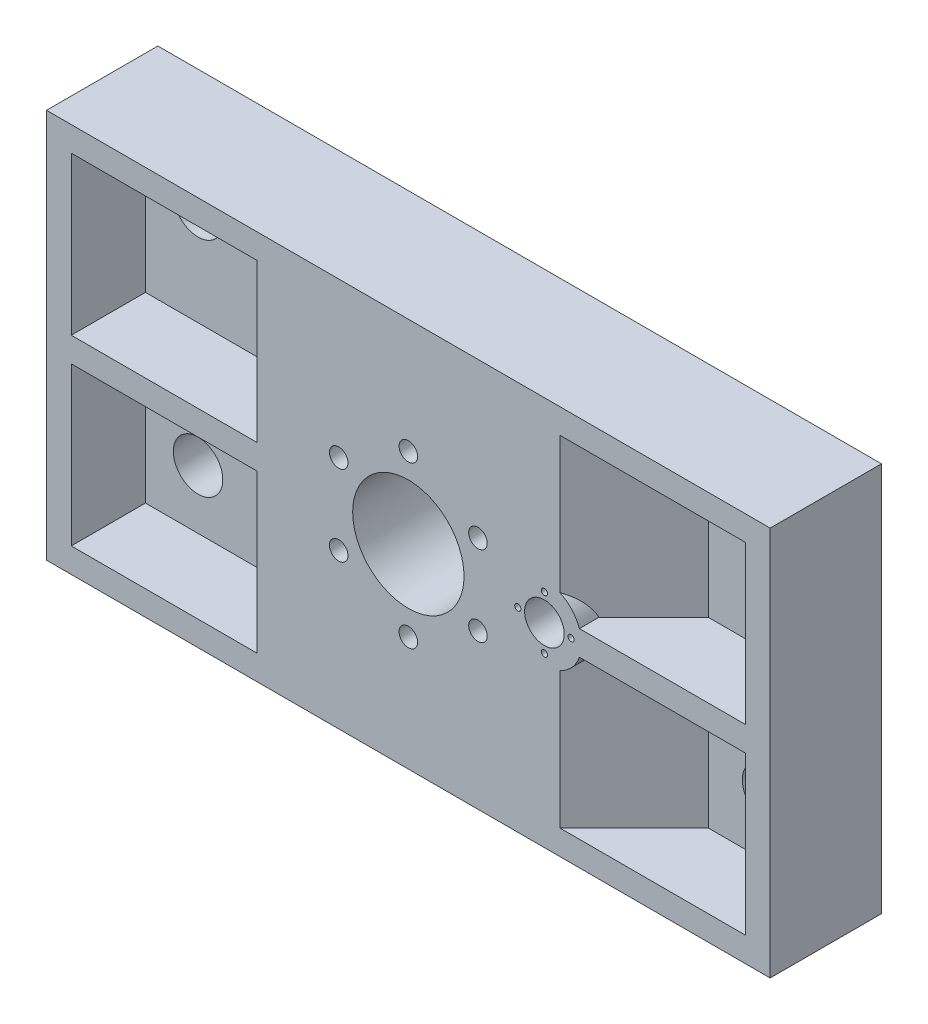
from build123d import *

# Parameters (mm, degrees)
SKETCH_1_W                = 585
SKETCH_1_H                = 315
SKETCH_1_R                = 45
SKETCH_1_R_2              = 7.5
SKETCH_1_R_3              = 20
SKETCH_1_R_4              = 16
SKETCH_1_R_5              = 2.5
EXTRUDE_1_DEPTH           = 90
SKETCH_2_W                = 90
SKETCH_2_H                = 127.5
CUT_EXTRUDE_1_DEPTH       = 60
CUT_EXTRUDE_2_DEPTH       = 127.5
CUT_EXTRUDE_3_DEPTH       = 127.5
CUT_EXTRUDE_4_DEPTH       = 127.5
CUT_EXTRUDE_5_DEPTH       = 127.5
EXTRUDE_2_REACH           = 346.184
CUT_EXTRUDE_START         = -60
CUT_EXTRUDE_6_DEPTH       = 60
EXTRUDE_START             = 40
SKETCH_9_R                = 7.5
SKETCH_9_R_2              = 45
EXTRUDE_7_DEPTH           = 40
CUT_EXTRUDE_8_DEPTH       = 127.5
CUT_EXTRUDE_9_DEPTH       = 127.5
CUT_EXTRUDE_16_DEPTH      = 48
CUT_EXTRUDE_16_DEPTH_BACK = 55
SKETCH_15_W               = 20
SKETCH_15_H               = 20
CUT_EXTRUDE_17_DEPTH      = 2
EXTRUDE_START_2           = -40
SKETCH_16_R               = 2.5
EXTRUDE_8_DEPTH           = 40
SKETCH_17_R               = 12.5
CUT_EXTRUDE_18_DEPTH      = 20


with BuildPart() as part:
    # Sketch 1 → Extrude 1 (new body)
    with BuildSketch(Plane.XY):
        Rectangle(SKETCH_1_W, SKETCH_1_H)
        with Locations(Location((0, 0, 0), (0, 0, 180))):
            Circle(SKETCH_1_R, mode=Mode.SUBTRACT)
        with Locations(Location((0, -65, 0), (0, 0, 180))):
            Circle(SKETCH_1_R_2, mode=Mode.SUBTRACT)
        with Locations(Location((-56.291651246, -32.5, 0), (0, 0, 180))):
            Circle(SKETCH_1_R_2, mode=Mode.SUBTRACT)
        with Locations(Location((-56.291651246, 32.5, 0), (0, 0, 180))):
            Circle(SKETCH_1_R_2, mode=Mode.SUBTRACT)
        with Locations(Location((0, 65, 0), (0, 0, 180))):
            Circle(SKETCH_1_R_2, mode=Mode.SUBTRACT)
        with Locations(Location((56.291651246, 32.5, 0), (0, 0, 180))):
            Circle(SKETCH_1_R_2, mode=Mode.SUBTRACT)
        with Locations(Location((56.291651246, -32.5, 0), (0, 0, 180))):
            Circle(SKETCH_1_R_2, mode=Mode.SUBTRACT)
        with Locations(Location((-230, -90, 0), (0, 0, 180))):
            Circle(SKETCH_1_R_3, mode=Mode.SUBTRACT)
        with Locations(Location((-230, 90, 0), (0, 0, 180))):
            Circle(SKETCH_1_R_3, mode=Mode.SUBTRACT)
        with Locations(Location((230, -90, 0), (0, 0, 180))):
            Circle(SKETCH_1_R_3, mode=Mode.SUBTRACT)
        with Locations(Location((230, 90, 0), (0, 0, 180))):
            Circle(SKETCH_1_R_3, mode=Mode.SUBTRACT)
        with Locations(Location((110, 0, 0), (0, 0, 180))):
            Circle(SKETCH_1_R_4, mode=Mode.SUBTRACT)
        with Locations(Location((110, -21.5, 0), (0, 0, 180))):
            Circle(SKETCH_1_R_5, mode=Mode.SUBTRACT)
        with Locations(Location((131.5, 0, 0), (0, 0, 180))):
            Circle(SKETCH_1_R_5, mode=Mode.SUBTRACT)
        with Locations(Location((88.5, 0, 0), (0, 0, 180))):
            Circle(SKETCH_1_R_5, mode=Mode.SUBTRACT)
        with Locations(Location((110, 21.5, 0), (0, 0, 180))):
            Circle(SKETCH_1_R_5, mode=Mode.SUBTRACT)
    extrude(amount=EXTRUDE_1_DEPTH)

    # Sketch 2 → Cut-Extrude 1 (cut)
    with BuildSketch(Plane.XY.offset(90)):
        with Locations((-227.5, 73.75)):
            Rectangle(SKETCH_2_W, SKETCH_2_H)
        with Locations((-227.5, -73.75)):
            Rectangle(SKETCH_2_W, SKETCH_2_H)
        with Locations((227.5, -73.75)):
            Rectangle(SKETCH_2_W, SKETCH_2_H)
        with Locations((227.5, 73.75)):
            Rectangle(SKETCH_2_W, SKETCH_2_H)
    extrude(amount=-CUT_EXTRUDE_1_DEPTH, mode=Mode.SUBTRACT)

    # Sketch 3 → Cut-Extrude 2 (cut)
    with BuildSketch(Plane.XZ.offset(10)):
        Polygon((-182.5, 30), (-122.5, 90), (-182.5, 90), align=None)
    extrude(amount=CUT_EXTRUDE_2_DEPTH, mode=Mode.SUBTRACT)

    # Sketch 4 → Cut-Extrude 3 (cut)
    with BuildSketch(Plane.XZ.offset(-137.5)):
        Polygon((-122.5, 90), (-182.5, 90), (-182.5, 30), align=None)
    extrude(amount=CUT_EXTRUDE_3_DEPTH, mode=Mode.SUBTRACT)

    # Sketch 5 → Cut-Extrude 4 (cut)
    with BuildSketch(Plane.XZ.offset(10)):
        Polygon((182.5, 30), (182.5, 90), (122.5, 90), align=None)
    extrude(amount=CUT_EXTRUDE_4_DEPTH, mode=Mode.SUBTRACT)

    # Sketch 6 → Cut-Extrude 5 (cut)
    with BuildSketch(Plane.XZ.offset(-137.5)):
        Polygon((182.5, 90), (122.5, 90), (182.5, 30), align=None)
    extrude(amount=CUT_EXTRUDE_5_DEPTH, mode=Mode.SUBTRACT)

    # Extrude 2: up to this face of the body (flat: up to its plane)
    extrude_2_end = Plane(part.part.faces().sort_by_distance((152.5, -73.75, 60))[0])
    # Sketch 7 → Extrude 2 (add, up to the picked face)
    with BuildSketch(Plane.XY.offset(90), mode=Mode.PRIVATE) as extrude_2_sk1:
        with BuildLine():
            Line((122.5, 10), (122.5, 27.271780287))
            ThreePointArc((122.5, 27.271780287), (132.145378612, 20.238137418), (138.284271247, 10))
            Line((138.284271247, 10), (122.5, 10))
        make_face()
    extrude_2_tool1 = split(extrude(extrude_2_sk1.sketch, amount=-EXTRUDE_2_REACH, mode=Mode.PRIVATE), bisect_by=extrude_2_end, keep=Keep.BOTH, mode=Mode.PRIVATE)
    # Sketch 7 → Extrude 2 (add, up to the picked face)
    with BuildSketch(Plane.XY.offset(90), mode=Mode.PRIVATE) as extrude_2_sk2:
        with BuildLine():
            Line((138.284271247, -10), (122.5, -10))
            Line((122.5, -10), (122.5, -27.271780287))
            ThreePointArc((122.5, -27.271780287), (132.145378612, -20.238137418), (138.284271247, -10))
        make_face()
    extrude_2_tool2 = split(extrude(extrude_2_sk2.sketch, amount=-EXTRUDE_2_REACH, mode=Mode.PRIVATE), bisect_by=extrude_2_end, keep=Keep.BOTH, mode=Mode.PRIVATE)
    add(extrude_2_tool1.solids().sort_by(Axis((128.4786, 16.514723, 90), (0, 0, -1)))[0])
    add(extrude_2_tool2.solids().sort_by(Axis((128.4786, -16.514723, 90), (0, 0, -1)))[0])

    # Sketch 8 → Cut-Extrude 6 (cut)
    with BuildSketch(Plane(origin=(0, 0, 0), x_dir=(-1, 0, 0), z_dir=(0, 0, -1)).offset(CUT_EXTRUDE_START)):
        with BuildLine():
            Line((-102.5, -29.047375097), (-102.5, -137.5))
            Line((-102.5, -137.5), (102.5, -137.5))
            Line((102.5, -137.5), (102.5, 137.5))
            Line((102.5, 137.5), (-102.5, 137.5))
            Line((-102.5, 137.5), (-102.5, 29.047375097))
            ThreePointArc((-102.5, 29.047375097), (-80, 0), (-102.5, -29.047375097))
        make_face()
    extrude(amount=CUT_EXTRUDE_6_DEPTH, mode=Mode.SUBTRACT)

    # Sketch 9 → Extrude 7 (add)
    with BuildSketch(Plane(origin=(0, 0, 60), x_dir=(-1, 0, 0), z_dir=(0, 0, -1)).offset(EXTRUDE_START)):
        with BuildLine():
            Line((10, 79.372539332), (10, 137.5))
            Line((10, 137.5), (-10, 137.5))
            Line((-10, 137.5), (-10, 79.372539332))
            ThreePointArc((-10, 79.372539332), (-56.568542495, 56.568542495), (-79.372539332, 10))
            Line((-79.372539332, 10), (-81.715728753, 10))
            ThreePointArc((-81.715728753, 10), (-80, 0), (-81.715728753, -10))
            Line((-81.715728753, -10), (-79.372539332, -10))
            ThreePointArc((-79.372539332, -10), (-56.568542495, -56.568542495), (-10, -79.372539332))
            Line((-10, -79.372539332), (-10, -137.5))
            Line((-10, -137.5), (10, -137.5))
            Line((10, -137.5), (10, -79.372539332))
            ThreePointArc((10, -79.372539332), (56.568542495, -56.568542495), (79.372539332, -10))
            Line((79.372539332, -10), (102.5, -10))
            Line((102.5, -10), (102.5, 10))
            Line((102.5, 10), (79.372539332, 10))
            ThreePointArc((79.372539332, 10), (56.568542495, 56.568542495), (10, 79.372539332))
        make_face()
        with Locations((-56.291651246, -32.5)):
            Circle(SKETCH_9_R, mode=Mode.SUBTRACT)
        with Locations((0, -65)):
            Circle(SKETCH_9_R, mode=Mode.SUBTRACT)
        with Locations((56.291651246, -32.5)):
            Circle(SKETCH_9_R, mode=Mode.SUBTRACT)
        with Locations((-56.291651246, 32.5)):
            Circle(SKETCH_9_R, mode=Mode.SUBTRACT)
        Circle(SKETCH_9_R_2, mode=Mode.SUBTRACT)
        with Locations((0, 65)):
            Circle(SKETCH_9_R, mode=Mode.SUBTRACT)
        with Locations((56.291651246, 32.5)):
            Circle(SKETCH_9_R, mode=Mode.SUBTRACT)
    extrude(amount=-EXTRUDE_7_DEPTH)

    # Sketch 11 → Cut-Extrude 8 (cut)
    with BuildSketch(Plane.XZ.offset(10)):
        Polygon((-102.5, 0), (-102.5, 60), (-162.5, 0), align=None)
        Polygon((102.5, 0), (102.5, 60), (162.5, 0), align=None)
    extrude(amount=CUT_EXTRUDE_8_DEPTH, mode=Mode.SUBTRACT)

    # Sketch 12 → Cut-Extrude 9 (cut)
    with BuildSketch(Plane.XZ.offset(-137.5)):
        Polygon((102.5, 60), (102.5, 0), (162.5, 0), align=None)
        Polygon((-102.5, 60), (-102.5, 0), (-162.5, 0), align=None)
    extrude(amount=CUT_EXTRUDE_9_DEPTH, mode=Mode.SUBTRACT)

    # Sketch 13 → Cut-Extrude 16 (cut, two sides: drawn at the far end of the back side and taken through both)
    with BuildSketch(Plane.XZ.offset(10).offset(-CUT_EXTRUDE_16_DEPTH_BACK)):
        Polygon((-142.5, 20), (-162.5, 0), (-102.5, 0), (-102.5, 20), align=None)
        Polygon((142.5, 20), (162.5, 0), (81.715728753, 0), (81.715728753, 20), align=None)
    extrude(amount=CUT_EXTRUDE_16_DEPTH + CUT_EXTRUDE_16_DEPTH_BACK, mode=Mode.SUBTRACT)

    # Sketch 15 → Cut-Extrude 17 (cut)
    with BuildSketch(Plane(origin=(81.715728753, 0, 0), x_dir=(0, 0, -1), z_dir=(1, 0, 0))):
        with Locations((-10, 0)):
            Rectangle(SKETCH_15_W, SKETCH_15_H)
    extrude(amount=-CUT_EXTRUDE_17_DEPTH, mode=Mode.SUBTRACT)

    # Sketch 16 → Extrude 8 (add)
    # profile 1 of 2: a face of its own
    with BuildSketch(Plane(origin=(0, 0, 20), x_dir=(-1, 0, 0), z_dir=(0, 0, -1)).offset(EXTRUDE_START_2)):
        with BuildLine():
            Line((-122.489995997, 10), (-138.284271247, 10))
            ThreePointArc((-138.284271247, 10), (-124.095996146, 26.482124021), (-102.5, 29.047375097))
            Line((-102.5, 29.047375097), (-102.5, 14.133294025))
            ThreePointArc((-102.5, 14.133294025), (-113.239760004, 15.668565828), (-122.489995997, 10))
        make_face()
        with Locations((-110, 21.5)):
            Circle(SKETCH_16_R, mode=Mode.SUBTRACT)
    # profile 2 of 2: a face of its own
    with BuildSketch(Plane(origin=(0, 0, 20), x_dir=(-1, 0, 0), z_dir=(0, 0, -1)).offset(EXTRUDE_START_2)):
        with BuildLine():
            Line((-138.284271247, -10), (-122.489995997, -10))
            ThreePointArc((-122.489995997, -10), (-113.239760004, -15.668565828), (-102.5, -14.133294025))
            Line((-102.5, -14.133294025), (-102.5, -29.047375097))
            ThreePointArc((-102.5, -29.047375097), (-124.095996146, -26.482124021), (-138.284271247, -10))
        make_face()
        with Locations((-110, -21.5)):
            Circle(SKETCH_16_R, mode=Mode.SUBTRACT)
    extrude(amount=EXTRUDE_8_DEPTH)

    # Sketch 17 → Cut-Extrude 18 (cut)
    with BuildSketch(Plane(origin=(0, 0, 20), x_dir=(-1, 0, 0), z_dir=(0, 0, -1))):
        with Locations((56.291651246, -32.5)):
            Circle(SKETCH_17_R)
        with Locations((0, -65)):
            Circle(SKETCH_17_R)
        with Locations((-56.291651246, -32.5)):
            Circle(SKETCH_17_R)
        with Locations((-56.291651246, 32.5)):
            Circle(SKETCH_17_R)
        with Locations((0, 65)):
            Circle(SKETCH_17_R)
        with Locations((56.291651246, 32.5)):
            Circle(SKETCH_17_R)
    extrude(amount=-CUT_EXTRUDE_18_DEPTH, mode=Mode.SUBTRACT)


solid = part.part
